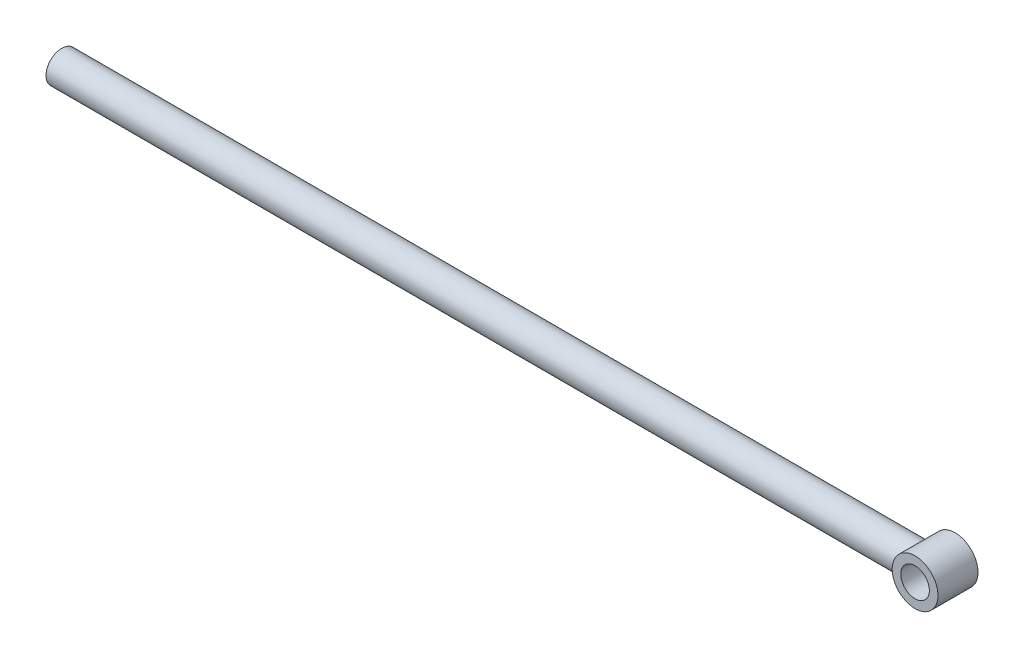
from build123d import *

# Parameters (mm, degrees)
ESQUISSE1_R      = 8
ESQUISSE1_R_2    = 5
EXTRUSION1_DEPTH = 14
ESQUISSE3_W      = 300
ESQUISSE3_H      = 3


with BuildPart() as part:
    # Esquisse1 → Extrusion1 (new body)
    with BuildSketch(Plane.XY):
        with Locations((282.839330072, 0)):
            Circle(ESQUISSE1_R)
        with Locations((282.839330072, 0)):
            Circle(ESQUISSE1_R_2, mode=Mode.SUBTRACT)
    extrude(amount=EXTRUSION1_DEPTH)

    # Esquisse3 → R_volution3 (revolve)
    with BuildSketch(Plane(origin=(0, 0, 0), x_dir=(1, 0, 0), z_dir=(0, 1, 0)), mode=Mode.PRIVATE) as r_volution3_sk:
        with Locations((127.45346664, -3)):
            Rectangle(ESQUISSE3_W, ESQUISSE3_H)
    revolve(r_volution3_sk.sketch.rotate(Axis((-116.634609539, 0, 7), (1, 0, 0)), 180), axis=Axis((-116.634609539, 0, 7), (1, 0, 0)))


solid = part.part
